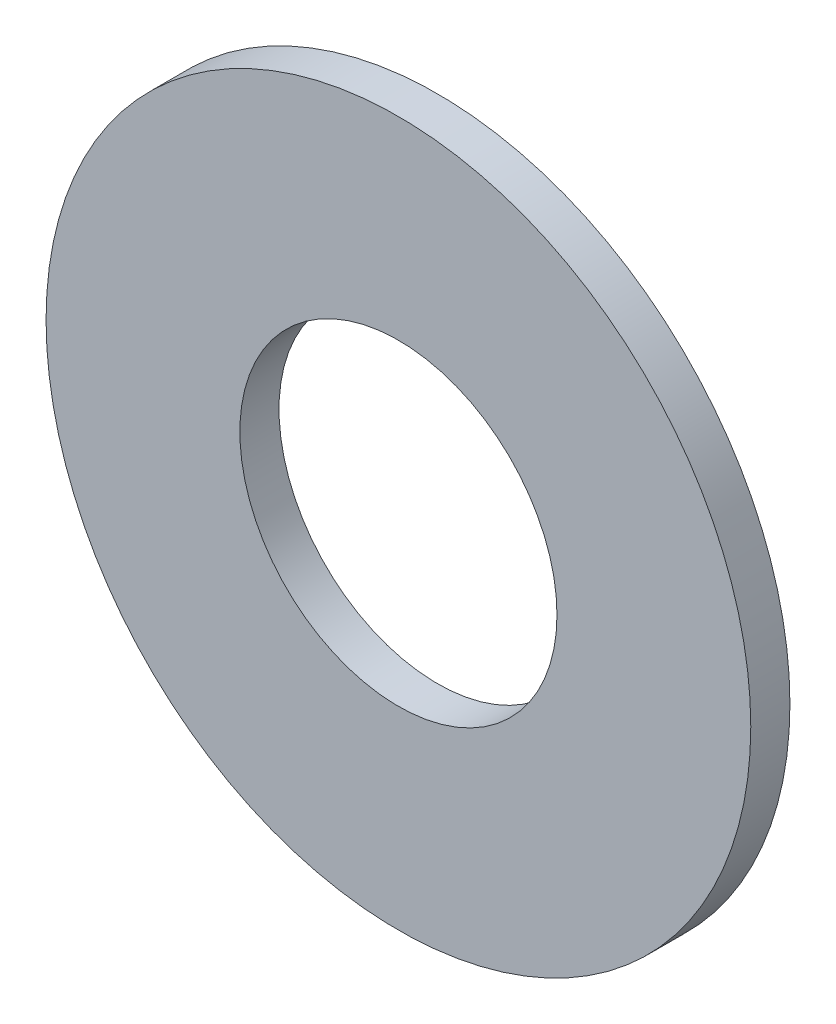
from build123d import *

# Parameters (mm, degrees)
ESQUISSE1_R      = 9
ESQUISSE1_R_2    = 4.05
EXTRUSION1_DEPTH = 1


with BuildPart() as part:
    # Esquisse1 → Extrusion1 (new body)
    with BuildSketch(Plane.XY):
        Circle(ESQUISSE1_R)
        Circle(ESQUISSE1_R_2, mode=Mode.SUBTRACT)
    extrude(amount=EXTRUSION1_DEPTH)


solid = part.part
